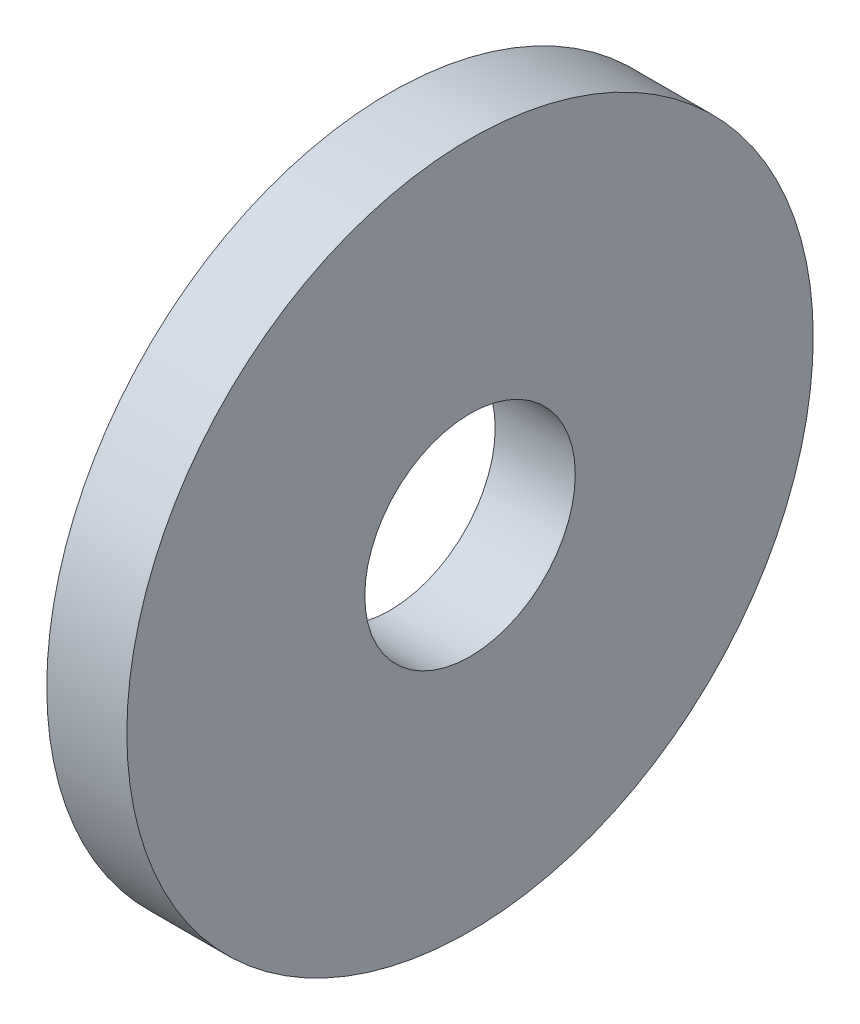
from build123d import *

# Parameters (mm, degrees)
SKETCH1_W = 1.4
SKETCH1_H = 4.16


with BuildPart() as part:
    # Sketch1 → Base-Revolve (revolve)
    with BuildSketch(Plane.XY, mode=Mode.PRIVATE) as base_revolve_sk:
        with Locations((-0.7, 3.92)):
            Rectangle(SKETCH1_W, SKETCH1_H)
    revolve(base_revolve_sk.sketch.rotate(Axis((-34.925, 0, 0), (1, 0, 0)), 90), axis=Axis((-34.925, 0, 0), (1, 0, 0)))


solid = part.part
